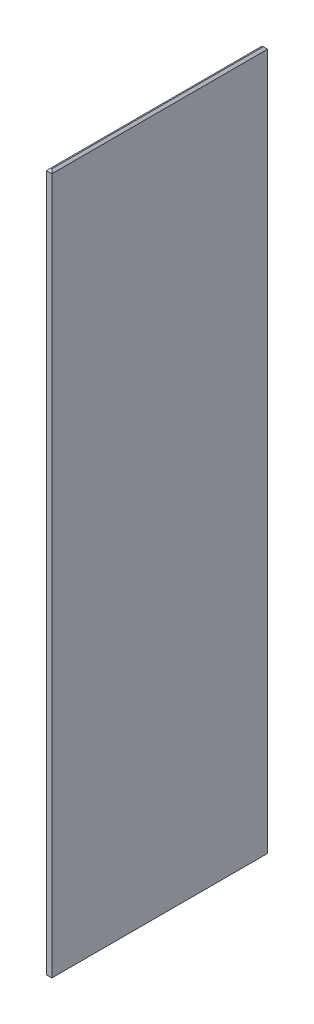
from build123d import *

# Parameters (mm, degrees)
SKETCH1_W           = 76.2
SKETCH1_H           = 3000
BOSS_EXTRUDE1_DEPTH = 9739.6
CHAMFER1_SIZE       = 30


with BuildPart() as part:
    # Sketch1 → Boss-Extrude1 (new body)
    with BuildSketch(Plane(origin=(0, 0, 0), x_dir=(-1, 0, 0), z_dir=(0, 1, 0))):
        Rectangle(SKETCH1_W, SKETCH1_H)
    extrude(amount=BOSS_EXTRUDE1_DEPTH)

    # Chamfer1
    chamfer1_edges = [part.edges().sort_by_distance(p)[0] for p in [
        (38.1, 9739.6, 0),
        (0, 9739.6, -1500),
        (-38.1, 9739.6, 0),
        (0, 0, -1500),
        (38.1, 0, 0),
        (0, 0, 1500),
        (-38.1, 0, 0),
        (0, 9739.6, 1500),
    ]]
    chamfer(chamfer1_edges, length=CHAMFER1_SIZE)


solid = part.part
